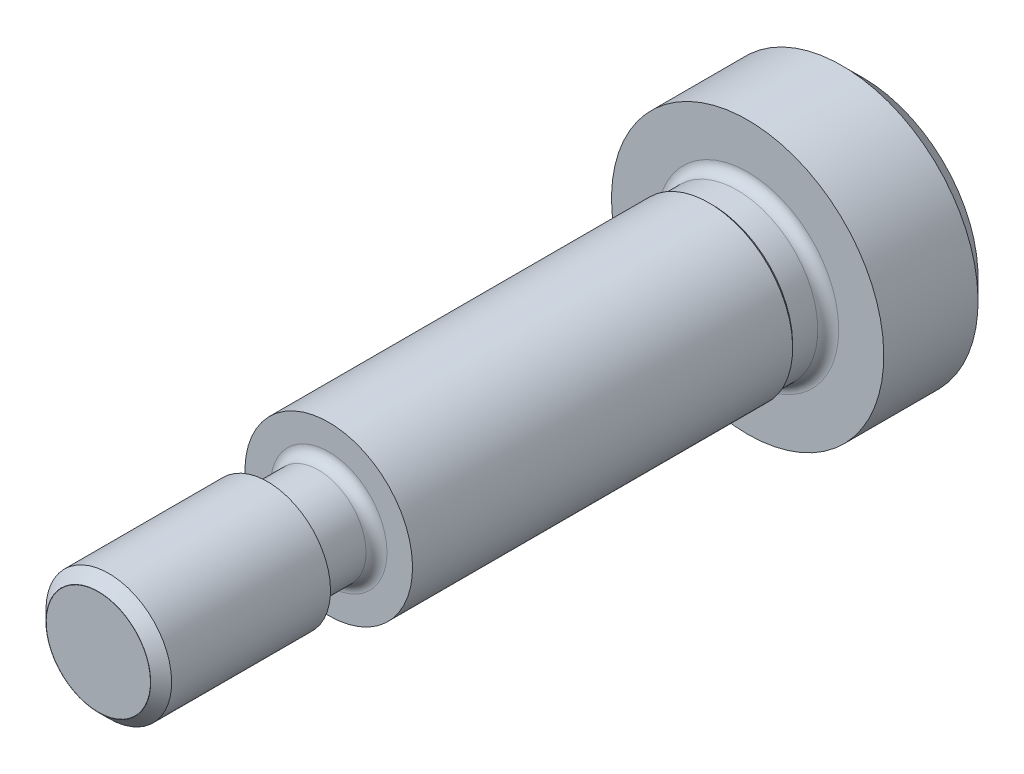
from build123d import *

# Parameters (mm, degrees)
CUT_EXTRUDE1_DEPTH = 3.3


with BuildPart() as part:
    # Sketch1 → Revolve1 (revolve)
    with BuildSketch(Plane(origin=(0, 0, 0), x_dir=(0, 0, -1), z_dir=(1, 0, 0)), mode=Mode.PRIVATE) as revolve1_sk:
        with BuildLine():
            Line((5.5, 2), (5.5, 5.5))
            Line((5.5, 5.5), (4.5, 6.5))
            Line((4.5, 6.5), (0, 6.5))
            Line((0, 6.5), (0, 4.35))
            ThreePointArc((0, 4.35), (-0.146446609, 3.996446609), (-0.5, 3.85))
            Line((-0.5, 3.85), (-1.7, 3.85))
            Line((-1.7, 3.85), (-1.85, 4))
            Line((-1.85, 4), (-20, 4))
            Line((-20, 4), (-20, 2.78))
            ThreePointArc((-20, 2.78), (-20.146446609, 2.426446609), (-20.5, 2.28))
            Line((-20.5, 2.28), (-22.5, 2.28))
            Line((-22.5, 2.28), (-22.915692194, 3))
            Line((-22.915692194, 3), (-30.5, 3))
            Line((-30.5, 3), (-31, 2.5))
            Line((-31, 2.5), (-22.638564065, 2.5))
            Line((-22.638564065, 2.5), (-22.632790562, 2.49))
            Line((-22.632790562, 2.49), (-31, 2.49))
            Line((-31, 2.49), (-31, 0))
            Line((-31, 0), (0.998278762, 0))
            Line((0.998278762, 0), (2.2, 2))
            Line((2.2, 2), (5.5, 2))
        make_face()
    revolve(revolve1_sk.sketch.rotate(Axis((0, 0, -0.998278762), (0, 0, -1)), 180), axis=Axis((0, 0, -0.998278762), (0, 0, -1)))

    # Sketch2 → Cut-Extrude1 (cut)
    with BuildSketch(Plane(origin=(0, 0, -5.5), x_dir=(-1, 0, 0), z_dir=(0, 0, -1))):
        Polygon((1.154700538, -2), (2.309401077, 0), (1.154700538, 2), (-1.154700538, 2), (-2.309401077, 0), (-1.154700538, -2), align=None)
    extrude(amount=-CUT_EXTRUDE1_DEPTH, mode=Mode.SUBTRACT)


solid = part.part
